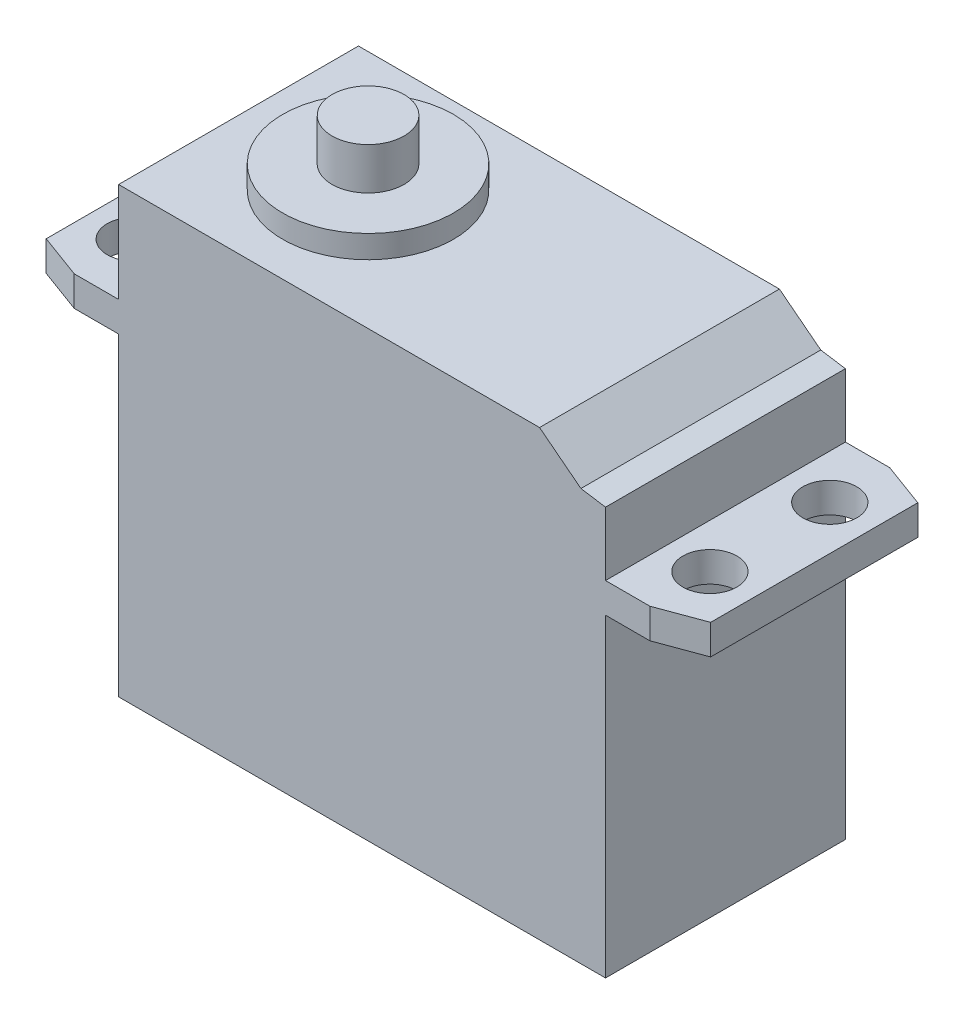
ISO-10303-21;
HEADER;
FILE_DESCRIPTION(('STEP AP214'),'2;1');
FILE_NAME('part.step','',(''),(''),'','','');
FILE_SCHEMA(('AUTOMOTIVE_DESIGN { 1 0 10303 214 1 1 1 1 }'));
ENDSEC;
DATA;
#1=APPLICATION_CONTEXT('core data for automotive mechanical design processes');
#2=APPLICATION_PROTOCOL_DEFINITION('international standard','automotive_design',2000,#1);
#3=PRODUCT_CONTEXT('',#1,'mechanical');
#4=PRODUCT('Part','Part','',(#3));
#5=PRODUCT_RELATED_PRODUCT_CATEGORY('part','',(#4));
#6=PRODUCT_DEFINITION_FORMATION('','',#4);
#7=PRODUCT_DEFINITION_CONTEXT('part definition',#1,'design');
#8=PRODUCT_DEFINITION('design','',#6,#7);
#9=PRODUCT_DEFINITION_SHAPE('','',#8);
#10=(LENGTH_UNIT() NAMED_UNIT(*) SI_UNIT(.MILLI.,.METRE.));
#11=(NAMED_UNIT(*) PLANE_ANGLE_UNIT() SI_UNIT($,.RADIAN.));
#12=(NAMED_UNIT(*) SI_UNIT($,.STERADIAN.) SOLID_ANGLE_UNIT());
#13=UNCERTAINTY_MEASURE_WITH_UNIT(LENGTH_MEASURE(1.E-05),#10,'distance_accuracy_value','');
#14=(GEOMETRIC_REPRESENTATION_CONTEXT(3) GLOBAL_UNCERTAINTY_ASSIGNED_CONTEXT((#13)) GLOBAL_UNIT_ASSIGNED_CONTEXT((#10,
#11,#12)) REPRESENTATION_CONTEXT('',''));
#15=CARTESIAN_POINT('',(0.,0.,0.));
#16=DIRECTION('',(0.,0.,1.));
#17=DIRECTION('',(1.,0.,0.));
#18=AXIS2_PLACEMENT_3D('',#15,#16,#17);
#19=CARTESIAN_POINT('',(0.,37.,0.));
#20=DIRECTION('',(1.,0.,0.));
#21=DIRECTION('',(0.,0.,-1.));
#22=AXIS2_PLACEMENT_3D('',#19,#20,#21);
#23=PLANE('',#22);
#24=DIRECTION('',(0.,-1.,0.));
#25=VECTOR('',#24,1.);
#26=CARTESIAN_POINT('',(0.,0.,-13.375));
#27=LINE('',#26,#25);
#28=CARTESIAN_POINT('',(0.,3.7,-13.375));
#29=VERTEX_POINT('',#28);
#30=CARTESIAN_POINT('',(0.,0.,-13.375));
#31=VERTEX_POINT('',#30);
#32=EDGE_CURVE('E55',#29,#31,#27,.T.);
#33=ORIENTED_EDGE('',*,*,#32,.F.);
#34=DIRECTION('',(0.,0.,-1.));
#35=VECTOR('',#34,1.);
#36=CARTESIAN_POINT('',(0.,3.7,-13.375));
#37=LINE('',#36,#35);
#38=CARTESIAN_POINT('',(0.,3.7,-6.625));
#39=VERTEX_POINT('',#38);
#40=EDGE_CURVE('E59',#39,#29,#37,.T.);
#41=ORIENTED_EDGE('',*,*,#40,.F.);
#42=DIRECTION('',(0.,1.,0.));
#43=VECTOR('',#42,1.);
#44=CARTESIAN_POINT('',(0.,0.,-6.625));
#45=LINE('',#44,#43);
#46=CARTESIAN_POINT('',(0.,0.,-6.625));
#47=VERTEX_POINT('',#46);
#48=EDGE_CURVE('E740',#47,#39,#45,.T.);
#49=ORIENTED_EDGE('',*,*,#48,.F.);
#50=DIRECTION('',(0.,0.,1.));
#51=VECTOR('',#50,1.);
#52=CARTESIAN_POINT('',(0.,0.,0.));
#53=LINE('',#52,#51);
#54=CARTESIAN_POINT('',(0.,0.,0.));
#55=VERTEX_POINT('',#54);
#56=EDGE_CURVE('E394',#47,#55,#53,.T.);
#57=ORIENTED_EDGE('',*,*,#56,.T.);
#58=DIRECTION('',(0.,-1.,0.));
#59=VECTOR('',#58,1.);
#60=CARTESIAN_POINT('',(0.,37.,0.));
#61=LINE('',#60,#59);
#62=CARTESIAN_POINT('',(0.,26.2,0.));
#63=VERTEX_POINT('',#62);
#64=EDGE_CURVE('E337',#63,#55,#61,.T.);
#65=ORIENTED_EDGE('',*,*,#64,.F.);
#66=DIRECTION('',(0.,0.,-1.));
#67=VECTOR('',#66,1.);
#68=CARTESIAN_POINT('',(0.,26.2,0.));
#69=LINE('',#68,#67);
#70=CARTESIAN_POINT('',(0.,26.2,-20.));
#71=VERTEX_POINT('',#70);
#72=EDGE_CURVE('E279',#63,#71,#69,.T.);
#73=ORIENTED_EDGE('',*,*,#72,.T.);
#74=DIRECTION('',(0.,-1.,0.));
#75=VECTOR('',#74,1.);
#76=CARTESIAN_POINT('',(0.,37.,-20.));
#77=LINE('',#76,#75);
#78=CARTESIAN_POINT('',(0.,0.,-20.));
#79=VERTEX_POINT('',#78);
#80=EDGE_CURVE('E290',#71,#79,#77,.T.);
#81=ORIENTED_EDGE('',*,*,#80,.T.);
#82=EDGE_CURVE('E409',#79,#31,#53,.T.);
#83=ORIENTED_EDGE('',*,*,#82,.T.);
#84=EDGE_LOOP('',(#33,#41,#49,#57,#65,#73,#81,#83));
#85=FACE_BOUND('',#84,.T.);
#86=ADVANCED_FACE('F37',(#85),#23,.F.);
#87=CARTESIAN_POINT('',(10.8,38.9,-10.));
#88=DIRECTION('',(0.,1.,0.));
#89=DIRECTION('',(0.,0.,1.));
#90=AXIS2_PLACEMENT_3D('',#87,#88,#89);
#91=PLANE('',#90);
#92=CARTESIAN_POINT('',(10.8,38.9,-10.));
#93=DIRECTION('',(0.,1.,0.));
#94=DIRECTION('',(0.,0.,1.));
#95=AXIS2_PLACEMENT_3D('',#92,#93,#94);
#96=CIRCLE('',#95,7.125);
#97=CARTESIAN_POINT('',(10.8,38.9,-17.125));
#98=VERTEX_POINT('',#97);
#99=EDGE_CURVE('E236',#98,#98,#96,.T.);
#100=ORIENTED_EDGE('',*,*,#99,.T.);
#101=EDGE_LOOP('',(#100));
#102=FACE_BOUND('',#101,.T.);
#103=CARTESIAN_POINT('',(10.8,38.9,-10.));
#104=DIRECTION('',(0.,1.,0.));
#105=DIRECTION('',(0.,0.,1.));
#106=AXIS2_PLACEMENT_3D('',#103,#104,#105);
#107=CIRCLE('',#106,3.);
#108=CARTESIAN_POINT('',(10.8,38.9,-7.));
#109=VERTEX_POINT('',#108);
#110=EDGE_CURVE('E229',#109,#109,#107,.T.);
#111=ORIENTED_EDGE('',*,*,#110,.F.);
#112=EDGE_LOOP('',(#111));
#113=FACE_BOUND('',#112,.T.);
#114=ADVANCED_FACE('F444',(#102,#113),#91,.T.);
#115=CARTESIAN_POINT('',(0.,37.,0.));
#116=DIRECTION('',(0.,-1.,0.));
#117=DIRECTION('',(0.,0.,-1.));
#118=AXIS2_PLACEMENT_3D('',#115,#116,#117);
#119=PLANE('',#118);
#120=DIRECTION('',(1.,0.,0.));
#121=VECTOR('',#120,1.);
#122=CARTESIAN_POINT('',(0.,37.,0.));
#123=LINE('',#122,#121);
#124=CARTESIAN_POINT('',(0.,37.,0.));
#125=VERTEX_POINT('',#124);
#126=CARTESIAN_POINT('',(35.1,37.,0.));
#127=VERTEX_POINT('',#126);
#128=EDGE_CURVE('E413',#125,#127,#123,.T.);
#129=ORIENTED_EDGE('',*,*,#128,.T.);
#130=DIRECTION('',(0.,0.,1.));
#131=VECTOR('',#130,1.);
#132=CARTESIAN_POINT('',(35.1,37.,-20.00105));
#133=LINE('',#132,#131);
#134=CARTESIAN_POINT('',(35.1,37.,-20.));
#135=VERTEX_POINT('',#134);
#136=EDGE_CURVE('E225',#135,#127,#133,.T.);
#137=ORIENTED_EDGE('',*,*,#136,.F.);
#138=DIRECTION('',(-1.,0.,0.));
#139=VECTOR('',#138,1.);
#140=CARTESIAN_POINT('',(0.,37.,-20.));
#141=LINE('',#140,#139);
#142=CARTESIAN_POINT('',(0.,37.,-20.));
#143=VERTEX_POINT('',#142);
#144=EDGE_CURVE('E335',#135,#143,#141,.T.);
#145=ORIENTED_EDGE('',*,*,#144,.T.);
#146=DIRECTION('',(0.,0.,1.));
#147=VECTOR('',#146,1.);
#148=CARTESIAN_POINT('',(0.,37.,0.));
#149=LINE('',#148,#147);
#150=EDGE_CURVE('E331',#143,#125,#149,.T.);
#151=ORIENTED_EDGE('',*,*,#150,.T.);
#152=EDGE_LOOP('',(#129,#137,#145,#151));
#153=FACE_BOUND('',#152,.T.);
#154=CARTESIAN_POINT('',(10.8,37.,-10.));
#155=DIRECTION('',(0.,-1.,0.));
#156=DIRECTION('',(0.,0.,-1.));
#157=AXIS2_PLACEMENT_3D('',#154,#155,#156);
#158=CIRCLE('',#157,7.125);
#159=CARTESIAN_POINT('',(10.8,37.,-17.125));
#160=VERTEX_POINT('',#159);
#161=EDGE_CURVE('E11',#160,#160,#158,.F.);
#162=ORIENTED_EDGE('',*,*,#161,.F.);
#163=EDGE_LOOP('',(#162));
#164=FACE_BOUND('',#163,.T.);
#165=ADVANCED_FACE('F448',(#153,#164),#119,.F.);
#166=CARTESIAN_POINT('',(-7.4,28.7,0.));
#167=DIRECTION('',(0.,1.,0.));
#168=DIRECTION('',(0.,0.,1.));
#169=AXIS2_PLACEMENT_3D('',#166,#167,#168);
#170=PLANE('',#169);
#171=CARTESIAN_POINT('',(-3.7,28.7,-15.));
#172=DIRECTION('',(0.,-1.,0.));
#173=DIRECTION('',(0.,0.,1.));
#174=AXIS2_PLACEMENT_3D('',#171,#172,#173);
#175=CIRCLE('',#174,2.25);
#176=CARTESIAN_POINT('',(-3.7,28.7,-12.75));
#177=VERTEX_POINT('',#176);
#178=EDGE_CURVE('E268',#177,#177,#175,.T.);
#179=ORIENTED_EDGE('',*,*,#178,.T.);
#180=EDGE_LOOP('',(#179));
#181=FACE_BOUND('',#180,.T.);
#182=CARTESIAN_POINT('',(-3.7,28.7,-5.));
#183=DIRECTION('',(0.,-1.,0.));
#184=DIRECTION('',(0.,0.,-1.));
#185=AXIS2_PLACEMENT_3D('',#182,#183,#184);
#186=CIRCLE('',#185,2.25);
#187=CARTESIAN_POINT('',(-3.7,28.7,-7.25));
#188=VERTEX_POINT('',#187);
#189=EDGE_CURVE('E261',#188,#188,#186,.T.);
#190=ORIENTED_EDGE('',*,*,#189,.T.);
#191=EDGE_LOOP('',(#190));
#192=FACE_BOUND('',#191,.T.);
#193=DIRECTION('',(0.,0.,1.));
#194=VECTOR('',#193,1.);
#195=CARTESIAN_POINT('',(-7.4,28.7,0.));
#196=LINE('',#195,#194);
#197=CARTESIAN_POINT('',(-7.4,28.7,-18.635703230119));
#198=VERTEX_POINT('',#197);
#199=CARTESIAN_POINT('',(-7.4,28.7,-1.36429676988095));
#200=VERTEX_POINT('',#199);
#201=EDGE_CURVE('E275',#198,#200,#196,.T.);
#202=ORIENTED_EDGE('',*,*,#201,.T.);
#203=DIRECTION('',(0.93824939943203,0.,0.345959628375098));
#204=VECTOR('',#203,1.);
#205=CARTESIAN_POINT('',(-3.7,28.7,0.));
#206=LINE('',#205,#204);
#207=CARTESIAN_POINT('',(-3.7,28.7,0.));
#208=VERTEX_POINT('',#207);
#209=EDGE_CURVE('E241',#200,#208,#206,.T.);
#210=ORIENTED_EDGE('',*,*,#209,.T.);
#211=DIRECTION('',(1.,0.,0.));
#212=VECTOR('',#211,1.);
#213=CARTESIAN_POINT('',(-7.4,28.7,0.));
#214=LINE('',#213,#212);
#215=CARTESIAN_POINT('',(0.,28.7,0.));
#216=VERTEX_POINT('',#215);
#217=EDGE_CURVE('E298',#208,#216,#214,.T.);
#218=ORIENTED_EDGE('',*,*,#217,.T.);
#219=DIRECTION('',(0.,0.,1.));
#220=VECTOR('',#219,1.);
#221=CARTESIAN_POINT('',(0.,28.7,0.));
#222=LINE('',#221,#220);
#223=CARTESIAN_POINT('',(0.,28.7,-20.));
#224=VERTEX_POINT('',#223);
#225=EDGE_CURVE('E274',#224,#216,#222,.T.);
#226=ORIENTED_EDGE('',*,*,#225,.F.);
#227=DIRECTION('',(1.,0.,0.));
#228=VECTOR('',#227,1.);
#229=CARTESIAN_POINT('',(-7.4,28.7,-20.));
#230=LINE('',#229,#228);
#231=CARTESIAN_POINT('',(-3.7,28.7,-20.));
#232=VERTEX_POINT('',#231);
#233=EDGE_CURVE('E302',#232,#224,#230,.T.);
#234=ORIENTED_EDGE('',*,*,#233,.F.);
#235=DIRECTION('',(-0.93824939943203,0.,0.345959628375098));
#236=VECTOR('',#235,1.);
#237=CARTESIAN_POINT('',(-3.7,28.7,-20.));
#238=LINE('',#237,#236);
#239=EDGE_CURVE('E254',#232,#198,#238,.T.);
#240=ORIENTED_EDGE('',*,*,#239,.T.);
#241=EDGE_LOOP('',(#202,#210,#218,#226,#234,#240));
#242=FACE_BOUND('',#241,.T.);
#243=ADVANCED_FACE('F325',(#181,#192,#242),#170,.T.);
#244=CARTESIAN_POINT('',(-7.4,26.2,0.));
#245=DIRECTION('',(0.,-1.,0.));
#246=DIRECTION('',(0.,0.,-1.));
#247=AXIS2_PLACEMENT_3D('',#244,#245,#246);
#248=PLANE('',#247);
#249=CARTESIAN_POINT('',(-3.7,26.2,-15.));
#250=DIRECTION('',(0.,-1.,0.));
#251=DIRECTION('',(0.,0.,-1.));
#252=AXIS2_PLACEMENT_3D('',#249,#250,#251);
#253=CIRCLE('',#252,2.25);
#254=CARTESIAN_POINT('',(-3.7,26.2,-17.25));
#255=VERTEX_POINT('',#254);
#256=EDGE_CURVE('E271',#255,#255,#253,.T.);
#257=ORIENTED_EDGE('',*,*,#256,.F.);
#258=EDGE_LOOP('',(#257));
#259=FACE_BOUND('',#258,.T.);
#260=CARTESIAN_POINT('',(-3.7,26.2,-5.));
#261=DIRECTION('',(0.,-1.,0.));
#262=DIRECTION('',(0.,0.,-1.));
#263=AXIS2_PLACEMENT_3D('',#260,#261,#262);
#264=CIRCLE('',#263,2.25);
#265=CARTESIAN_POINT('',(-3.7,26.2,-7.25));
#266=VERTEX_POINT('',#265);
#267=EDGE_CURVE('E265',#266,#266,#264,.T.);
#268=ORIENTED_EDGE('',*,*,#267,.F.);
#269=EDGE_LOOP('',(#268));
#270=FACE_BOUND('',#269,.T.);
#271=DIRECTION('',(1.,0.,0.));
#272=VECTOR('',#271,1.);
#273=CARTESIAN_POINT('',(-7.4,26.2,0.));
#274=LINE('',#273,#272);
#275=CARTESIAN_POINT('',(-3.70000000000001,26.2,0.));
#276=VERTEX_POINT('',#275);
#277=EDGE_CURVE('E281',#276,#63,#274,.T.);
#278=ORIENTED_EDGE('',*,*,#277,.F.);
#279=DIRECTION('',(0.93824939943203,0.,0.345959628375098));
#280=VECTOR('',#279,1.);
#281=CARTESIAN_POINT('',(-3.7,26.2,0.));
#282=LINE('',#281,#280);
#283=CARTESIAN_POINT('',(-7.4,26.2,-1.36429676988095));
#284=VERTEX_POINT('',#283);
#285=EDGE_CURVE('E248',#284,#276,#282,.T.);
#286=ORIENTED_EDGE('',*,*,#285,.F.);
#287=DIRECTION('',(0.,0.,-1.));
#288=VECTOR('',#287,1.);
#289=CARTESIAN_POINT('',(-7.4,26.2,0.));
#290=LINE('',#289,#288);
#291=CARTESIAN_POINT('',(-7.4,26.2,-18.635703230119));
#292=VERTEX_POINT('',#291);
#293=EDGE_CURVE('E278',#284,#292,#290,.T.);
#294=ORIENTED_EDGE('',*,*,#293,.T.);
#295=DIRECTION('',(-0.93824939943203,0.,0.345959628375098));
#296=VECTOR('',#295,1.);
#297=CARTESIAN_POINT('',(-3.7,26.2,-20.));
#298=LINE('',#297,#296);
#299=CARTESIAN_POINT('',(-3.7,26.2,-20.));
#300=VERTEX_POINT('',#299);
#301=EDGE_CURVE('E251',#300,#292,#298,.T.);
#302=ORIENTED_EDGE('',*,*,#301,.F.);
#303=DIRECTION('',(1.,0.,0.));
#304=VECTOR('',#303,1.);
#305=CARTESIAN_POINT('',(-7.4,26.2,-20.));
#306=LINE('',#305,#304);
#307=EDGE_CURVE('E305',#300,#71,#306,.T.);
#308=ORIENTED_EDGE('',*,*,#307,.T.);
#309=ORIENTED_EDGE('',*,*,#72,.F.);
#310=EDGE_LOOP('',(#278,#286,#294,#302,#308,#309));
#311=FACE_BOUND('',#310,.T.);
#312=ADVANCED_FACE('F420',(#259,#270,#311),#248,.T.);
#313=CARTESIAN_POINT('',(-7.4,0.,0.));
#314=DIRECTION('',(-1.,0.,0.));
#315=DIRECTION('',(0.,0.,-1.));
#316=AXIS2_PLACEMENT_3D('',#313,#314,#315);
#317=PLANE('',#316);
#318=ORIENTED_EDGE('',*,*,#293,.F.);
#319=DIRECTION('',(0.,1.,0.));
#320=VECTOR('',#319,1.);
#321=CARTESIAN_POINT('',(-7.4,-0.00102500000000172,-1.36429676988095));
#322=LINE('',#321,#320);
#323=EDGE_CURVE('E245',#284,#200,#322,.T.);
#324=ORIENTED_EDGE('',*,*,#323,.T.);
#325=ORIENTED_EDGE('',*,*,#201,.F.);
#326=DIRECTION('',(0.,1.,0.));
#327=VECTOR('',#326,1.);
#328=CARTESIAN_POINT('',(-7.4,-0.00102500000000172,-18.635703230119));
#329=LINE('',#328,#327);
#330=EDGE_CURVE('E257',#292,#198,#329,.T.);
#331=ORIENTED_EDGE('',*,*,#330,.F.);
#332=EDGE_LOOP('',(#318,#324,#325,#331));
#333=FACE_BOUND('',#332,.T.);
#334=ADVANCED_FACE('F426',(#333),#317,.T.);
#335=CARTESIAN_POINT('',(0.,37.,0.));
#336=DIRECTION('',(0.,0.,-1.));
#337=DIRECTION('',(-1.,0.,0.));
#338=AXIS2_PLACEMENT_3D('',#335,#336,#337);
#339=PLANE('',#338);
#340=DIRECTION('',(0.,-1.,0.));
#341=VECTOR('',#340,1.);
#342=CARTESIAN_POINT('',(40.6,37.,0.));
#343=LINE('',#342,#341);
#344=CARTESIAN_POINT('',(40.6,34.,0.));
#345=VERTEX_POINT('',#344);
#346=CARTESIAN_POINT('',(40.6,28.7,0.));
#347=VERTEX_POINT('',#346);
#348=EDGE_CURVE('E41',#345,#347,#343,.T.);
#349=ORIENTED_EDGE('',*,*,#348,.F.);
#350=DIRECTION('',(0.987921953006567,-0.154952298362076,0.));
#351=VECTOR('',#350,1.);
#352=CARTESIAN_POINT('',(40.6,34.,0.));
#353=LINE('',#352,#351);
#354=CARTESIAN_POINT('',(38.5477492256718,34.3218887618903,0.));
#355=VERTEX_POINT('',#354);
#356=EDGE_CURVE('E223',#355,#345,#353,.T.);
#357=ORIENTED_EDGE('',*,*,#356,.F.);
#358=DIRECTION('',(0.789737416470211,-0.613445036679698,0.));
#359=VECTOR('',#358,1.);
#360=CARTESIAN_POINT('',(38.5477492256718,34.3218887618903,0.));
#361=LINE('',#360,#359);
#362=EDGE_CURVE('E220',#127,#355,#361,.T.);
#363=ORIENTED_EDGE('',*,*,#362,.F.);
#364=ORIENTED_EDGE('',*,*,#128,.F.);
#365=EDGE_CURVE('E47',#125,#216,#61,.T.);
#366=ORIENTED_EDGE('',*,*,#365,.T.);
#367=ORIENTED_EDGE('',*,*,#217,.F.);
#368=DIRECTION('',(0.,1.,0.));
#369=VECTOR('',#368,1.);
#370=CARTESIAN_POINT('',(-3.7,-0.00102500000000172,0.));
#371=LINE('',#370,#369);
#372=EDGE_CURVE('E244',#276,#208,#371,.T.);
#373=ORIENTED_EDGE('',*,*,#372,.F.);
#374=ORIENTED_EDGE('',*,*,#277,.T.);
#375=ORIENTED_EDGE('',*,*,#64,.T.);
#376=DIRECTION('',(1.,0.,0.));
#377=VECTOR('',#376,1.);
#378=CARTESIAN_POINT('',(0.,0.,0.));
#379=LINE('',#378,#377);
#380=CARTESIAN_POINT('',(40.6,0.,0.));
#381=VERTEX_POINT('',#380);
#382=EDGE_CURVE('E403',#55,#381,#379,.T.);
#383=ORIENTED_EDGE('',*,*,#382,.T.);
#384=CARTESIAN_POINT('',(40.6,26.2,0.));
#385=VERTEX_POINT('',#384);
#386=EDGE_CURVE('E350',#385,#381,#343,.T.);
#387=ORIENTED_EDGE('',*,*,#386,.F.);
#388=DIRECTION('',(-1.,0.,0.));
#389=VECTOR('',#388,1.);
#390=CARTESIAN_POINT('',(48.,26.2,0.));
#391=LINE('',#390,#389);
#392=CARTESIAN_POINT('',(44.3,26.2,0.));
#393=VERTEX_POINT('',#392);
#394=EDGE_CURVE('E393',#393,#385,#391,.T.);
#395=ORIENTED_EDGE('',*,*,#394,.F.);
#396=DIRECTION('',(0.,1.,0.));
#397=VECTOR('',#396,1.);
#398=CARTESIAN_POINT('',(44.3,-0.00102500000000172,0.));
#399=LINE('',#398,#397);
#400=CARTESIAN_POINT('',(44.3,28.7,0.));
#401=VERTEX_POINT('',#400);
#402=EDGE_CURVE('E764',#393,#401,#399,.T.);
#403=ORIENTED_EDGE('',*,*,#402,.T.);
#404=DIRECTION('',(-1.,0.,0.));
#405=VECTOR('',#404,1.);
#406=CARTESIAN_POINT('',(48.,28.7,0.));
#407=LINE('',#406,#405);
#408=EDGE_CURVE('E387',#401,#347,#407,.T.);
#409=ORIENTED_EDGE('',*,*,#408,.T.);
#410=EDGE_LOOP('',(#349,#357,#363,#364,#366,#367,#373,#374,#375,#383,#387,#395,#403,#409));
#411=FACE_BOUND('',#410,.T.);
#412=ADVANCED_FACE('F402',(#411),#339,.F.);
#413=CARTESIAN_POINT('',(0.,37.,-20.));
#414=DIRECTION('',(0.,0.,1.));
#415=DIRECTION('',(1.,0.,0.));
#416=AXIS2_PLACEMENT_3D('',#413,#414,#415);
#417=PLANE('',#416);
#418=DIRECTION('',(-0.789737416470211,0.613445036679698,0.));
#419=VECTOR('',#418,1.);
#420=CARTESIAN_POINT('',(38.5477492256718,34.3218887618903,-20.));
#421=LINE('',#420,#419);
#422=CARTESIAN_POINT('',(38.5477492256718,34.3218887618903,-20.));
#423=VERTEX_POINT('',#422);
#424=EDGE_CURVE('E210',#423,#135,#421,.T.);
#425=ORIENTED_EDGE('',*,*,#424,.F.);
#426=DIRECTION('',(-0.987921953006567,0.154952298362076,0.));
#427=VECTOR('',#426,1.);
#428=CARTESIAN_POINT('',(40.6,34.,-20.));
#429=LINE('',#428,#427);
#430=CARTESIAN_POINT('',(40.6,34.,-20.));
#431=VERTEX_POINT('',#430);
#432=EDGE_CURVE('E212',#431,#423,#429,.T.);
#433=ORIENTED_EDGE('',*,*,#432,.F.);
#434=DIRECTION('',(0.,-1.,0.));
#435=VECTOR('',#434,1.);
#436=CARTESIAN_POINT('',(40.6,37.,-20.));
#437=LINE('',#436,#435);
#438=CARTESIAN_POINT('',(40.6,28.7,-20.));
#439=VERTEX_POINT('',#438);
#440=EDGE_CURVE('E333',#431,#439,#437,.T.);
#441=ORIENTED_EDGE('',*,*,#440,.T.);
#442=DIRECTION('',(-1.,0.,0.));
#443=VECTOR('',#442,1.);
#444=CARTESIAN_POINT('',(48.,28.7,-20.));
#445=LINE('',#444,#443);
#446=CARTESIAN_POINT('',(44.3,28.7,-20.));
#447=VERTEX_POINT('',#446);
#448=EDGE_CURVE('E391',#447,#439,#445,.T.);
#449=ORIENTED_EDGE('',*,*,#448,.F.);
#450=DIRECTION('',(0.,1.,0.));
#451=VECTOR('',#450,1.);
#452=CARTESIAN_POINT('',(44.3,-0.00102500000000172,-20.));
#453=LINE('',#452,#451);
#454=CARTESIAN_POINT('',(44.3,26.2,-20.));
#455=VERTEX_POINT('',#454);
#456=EDGE_CURVE('E757',#455,#447,#453,.T.);
#457=ORIENTED_EDGE('',*,*,#456,.F.);
#458=DIRECTION('',(-1.,0.,0.));
#459=VECTOR('',#458,1.);
#460=CARTESIAN_POINT('',(48.,26.2,-20.));
#461=LINE('',#460,#459);
#462=CARTESIAN_POINT('',(40.6,26.2,-20.));
#463=VERTEX_POINT('',#462);
#464=EDGE_CURVE('E392',#455,#463,#461,.T.);
#465=ORIENTED_EDGE('',*,*,#464,.T.);
#466=CARTESIAN_POINT('',(40.6,0.,-20.));
#467=VERTEX_POINT('',#466);
#468=EDGE_CURVE('E332',#463,#467,#437,.T.);
#469=ORIENTED_EDGE('',*,*,#468,.T.);
#470=DIRECTION('',(-1.,0.,0.));
#471=VECTOR('',#470,1.);
#472=CARTESIAN_POINT('',(0.,0.,-20.));
#473=LINE('',#472,#471);
#474=EDGE_CURVE('E343',#467,#79,#473,.T.);
#475=ORIENTED_EDGE('',*,*,#474,.T.);
#476=ORIENTED_EDGE('',*,*,#80,.F.);
#477=ORIENTED_EDGE('',*,*,#307,.F.);
#478=DIRECTION('',(0.,1.,0.));
#479=VECTOR('',#478,1.);
#480=CARTESIAN_POINT('',(-3.7,-0.00102500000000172,-20.));
#481=LINE('',#480,#479);
#482=EDGE_CURVE('E258',#300,#232,#481,.T.);
#483=ORIENTED_EDGE('',*,*,#482,.T.);
#484=ORIENTED_EDGE('',*,*,#233,.T.);
#485=EDGE_CURVE('E322',#143,#224,#77,.T.);
#486=ORIENTED_EDGE('',*,*,#485,.F.);
#487=ORIENTED_EDGE('',*,*,#144,.F.);
#488=EDGE_LOOP('',(#425,#433,#441,#449,#457,#465,#469,#475,#476,#477,#483,#484,#486,#487));
#489=FACE_BOUND('',#488,.T.);
#490=ADVANCED_FACE('F319',(#489),#417,.F.);
#491=CARTESIAN_POINT('',(40.6,37.,0.));
#492=DIRECTION('',(-1.,0.,0.));
#493=DIRECTION('',(0.,0.,1.));
#494=AXIS2_PLACEMENT_3D('',#491,#492,#493);
#495=PLANE('',#494);
#496=ORIENTED_EDGE('',*,*,#440,.F.);
#497=DIRECTION('',(0.,0.,1.));
#498=VECTOR('',#497,1.);
#499=CARTESIAN_POINT('',(40.6,34.,-20.00105));
#500=LINE('',#499,#498);
#501=EDGE_CURVE('E226',#431,#345,#500,.T.);
#502=ORIENTED_EDGE('',*,*,#501,.T.);
#503=ORIENTED_EDGE('',*,*,#348,.T.);
#504=DIRECTION('',(0.,0.,1.));
#505=VECTOR('',#504,1.);
#506=CARTESIAN_POINT('',(40.6,28.7,0.));
#507=LINE('',#506,#505);
#508=EDGE_CURVE('E365',#439,#347,#507,.T.);
#509=ORIENTED_EDGE('',*,*,#508,.F.);
#510=EDGE_LOOP('',(#496,#502,#503,#509));
#511=FACE_BOUND('',#510,.T.);
#512=ADVANCED_FACE('F459',(#511),#495,.F.);
#513=DIRECTION('',(0.,0.,-1.));
#514=VECTOR('',#513,1.);
#515=CARTESIAN_POINT('',(40.6,26.2,0.));
#516=LINE('',#515,#514);
#517=EDGE_CURVE('E361',#385,#463,#516,.T.);
#518=ORIENTED_EDGE('',*,*,#517,.F.);
#519=ORIENTED_EDGE('',*,*,#386,.T.);
#520=DIRECTION('',(0.,0.,-1.));
#521=VECTOR('',#520,1.);
#522=CARTESIAN_POINT('',(40.6,0.,0.));
#523=LINE('',#522,#521);
#524=EDGE_CURVE('E408',#381,#467,#523,.T.);
#525=ORIENTED_EDGE('',*,*,#524,.T.);
#526=ORIENTED_EDGE('',*,*,#468,.F.);
#527=EDGE_LOOP('',(#518,#519,#525,#526));
#528=FACE_BOUND('',#527,.T.);
#529=ADVANCED_FACE('F452',(#528),#495,.F.);
#530=ORIENTED_EDGE('',*,*,#485,.T.);
#531=ORIENTED_EDGE('',*,*,#225,.T.);
#532=ORIENTED_EDGE('',*,*,#365,.F.);
#533=ORIENTED_EDGE('',*,*,#150,.F.);
#534=EDGE_LOOP('',(#530,#531,#532,#533));
#535=FACE_BOUND('',#534,.T.);
#536=ADVANCED_FACE('F39',(#535),#23,.F.);
#537=CARTESIAN_POINT('',(0.,0.,0.));
#538=DIRECTION('',(0.,-1.,0.));
#539=DIRECTION('',(0.,0.,-1.));
#540=AXIS2_PLACEMENT_3D('',#537,#538,#539);
#541=PLANE('',#540);
#542=ORIENTED_EDGE('',*,*,#82,.F.);
#543=ORIENTED_EDGE('',*,*,#474,.F.);
#544=ORIENTED_EDGE('',*,*,#524,.F.);
#545=ORIENTED_EDGE('',*,*,#382,.F.);
#546=ORIENTED_EDGE('',*,*,#56,.F.);
#547=DIRECTION('',(1.,0.,0.));
#548=VECTOR('',#547,1.);
#549=CARTESIAN_POINT('',(-2.,0.,-6.625));
#550=LINE('',#549,#548);
#551=CARTESIAN_POINT('',(-2.,0.,-6.625));
#552=VERTEX_POINT('',#551);
#553=EDGE_CURVE('E195',#552,#47,#550,.T.);
#554=ORIENTED_EDGE('',*,*,#553,.F.);
#555=DIRECTION('',(0.,0.,1.));
#556=VECTOR('',#555,1.);
#557=CARTESIAN_POINT('',(-2.,0.,-13.375));
#558=LINE('',#557,#556);
#559=CARTESIAN_POINT('',(-2.,0.,-13.375));
#560=VERTEX_POINT('',#559);
#561=EDGE_CURVE('E188',#560,#552,#558,.T.);
#562=ORIENTED_EDGE('',*,*,#561,.F.);
#563=DIRECTION('',(1.,0.,0.));
#564=VECTOR('',#563,1.);
#565=CARTESIAN_POINT('',(-2.,0.,-13.375));
#566=LINE('',#565,#564);
#567=EDGE_CURVE('E193',#560,#31,#566,.T.);
#568=ORIENTED_EDGE('',*,*,#567,.T.);
#569=EDGE_LOOP('',(#542,#543,#544,#545,#546,#554,#562,#568));
#570=FACE_BOUND('',#569,.T.);
#571=ADVANCED_FACE('F191',(#570),#541,.T.);
#572=CARTESIAN_POINT('',(48.,26.2,0.));
#573=DIRECTION('',(0.,1.,0.));
#574=DIRECTION('',(0.,0.,1.));
#575=AXIS2_PLACEMENT_3D('',#572,#573,#574);
#576=PLANE('',#575);
#577=CARTESIAN_POINT('',(44.3,26.2,-5.));
#578=DIRECTION('',(0.,1.,0.));
#579=DIRECTION('',(0.,0.,1.));
#580=AXIS2_PLACEMENT_3D('',#577,#578,#579);
#581=CIRCLE('',#580,2.25);
#582=CARTESIAN_POINT('',(44.3,26.2,-2.75));
#583=VERTEX_POINT('',#582);
#584=EDGE_CURVE('E781',#583,#583,#581,.F.);
#585=ORIENTED_EDGE('',*,*,#584,.F.);
#586=EDGE_LOOP('',(#585));
#587=FACE_BOUND('',#586,.T.);
#588=CARTESIAN_POINT('',(44.3,26.2,-15.));
#589=DIRECTION('',(0.,1.,0.));
#590=DIRECTION('',(0.,0.,1.));
#591=AXIS2_PLACEMENT_3D('',#588,#589,#590);
#592=CIRCLE('',#591,2.25);
#593=CARTESIAN_POINT('',(44.3,26.2,-12.75));
#594=VERTEX_POINT('',#593);
#595=EDGE_CURVE('E366',#594,#594,#592,.F.);
#596=ORIENTED_EDGE('',*,*,#595,.F.);
#597=EDGE_LOOP('',(#596));
#598=FACE_BOUND('',#597,.T.);
#599=DIRECTION('',(0.,0.,-1.));
#600=VECTOR('',#599,1.);
#601=CARTESIAN_POINT('',(48.,26.2,0.));
#602=LINE('',#601,#600);
#603=CARTESIAN_POINT('',(48.,26.2,-1.36429676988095));
#604=VERTEX_POINT('',#603);
#605=CARTESIAN_POINT('',(48.,26.2,-18.635703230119));
#606=VERTEX_POINT('',#605);
#607=EDGE_CURVE('E380',#604,#606,#602,.T.);
#608=ORIENTED_EDGE('',*,*,#607,.F.);
#609=DIRECTION('',(0.93824939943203,0.,-0.345959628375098));
#610=VECTOR('',#609,1.);
#611=CARTESIAN_POINT('',(44.3,26.2,0.));
#612=LINE('',#611,#610);
#613=EDGE_CURVE('E301',#393,#604,#612,.T.);
#614=ORIENTED_EDGE('',*,*,#613,.F.);
#615=ORIENTED_EDGE('',*,*,#394,.T.);
#616=ORIENTED_EDGE('',*,*,#517,.T.);
#617=ORIENTED_EDGE('',*,*,#464,.F.);
#618=DIRECTION('',(-0.93824939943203,0.,-0.345959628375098));
#619=VECTOR('',#618,1.);
#620=CARTESIAN_POINT('',(44.3,26.2,-20.));
#621=LINE('',#620,#619);
#622=EDGE_CURVE('E775',#606,#455,#621,.T.);
#623=ORIENTED_EDGE('',*,*,#622,.F.);
#624=EDGE_LOOP('',(#608,#614,#615,#616,#617,#623));
#625=FACE_BOUND('',#624,.T.);
#626=ADVANCED_FACE('F457',(#587,#598,#625),#576,.F.);
#627=CARTESIAN_POINT('',(48.,28.7,0.));
#628=DIRECTION('',(0.,-1.,0.));
#629=DIRECTION('',(0.,0.,-1.));
#630=AXIS2_PLACEMENT_3D('',#627,#628,#629);
#631=PLANE('',#630);
#632=CARTESIAN_POINT('',(44.3,28.7,-5.));
#633=DIRECTION('',(0.,1.,0.));
#634=DIRECTION('',(0.,0.,-1.));
#635=AXIS2_PLACEMENT_3D('',#632,#633,#634);
#636=CIRCLE('',#635,2.25);
#637=CARTESIAN_POINT('',(44.3,28.7,-7.25));
#638=VERTEX_POINT('',#637);
#639=EDGE_CURVE('E778',#638,#638,#636,.T.);
#640=ORIENTED_EDGE('',*,*,#639,.F.);
#641=EDGE_LOOP('',(#640));
#642=FACE_BOUND('',#641,.T.);
#643=CARTESIAN_POINT('',(44.3,28.7,-15.));
#644=DIRECTION('',(0.,1.,0.));
#645=DIRECTION('',(0.,0.,1.));
#646=AXIS2_PLACEMENT_3D('',#643,#644,#645);
#647=CIRCLE('',#646,2.25);
#648=CARTESIAN_POINT('',(44.3,28.7,-12.75));
#649=VERTEX_POINT('',#648);
#650=EDGE_CURVE('E784',#649,#649,#647,.T.);
#651=ORIENTED_EDGE('',*,*,#650,.F.);
#652=EDGE_LOOP('',(#651));
#653=FACE_BOUND('',#652,.T.);
#654=ORIENTED_EDGE('',*,*,#408,.F.);
#655=DIRECTION('',(-0.93824939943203,0.,0.345959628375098));
#656=VECTOR('',#655,1.);
#657=CARTESIAN_POINT('',(44.3,28.7,0.));
#658=LINE('',#657,#656);
#659=CARTESIAN_POINT('',(48.,28.7,-1.36429676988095));
#660=VERTEX_POINT('',#659);
#661=EDGE_CURVE('E768',#660,#401,#658,.T.);
#662=ORIENTED_EDGE('',*,*,#661,.F.);
#663=DIRECTION('',(0.,0.,1.));
#664=VECTOR('',#663,1.);
#665=CARTESIAN_POINT('',(48.,28.7,0.));
#666=LINE('',#665,#664);
#667=CARTESIAN_POINT('',(48.,28.7,-18.635703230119));
#668=VERTEX_POINT('',#667);
#669=EDGE_CURVE('E372',#668,#660,#666,.T.);
#670=ORIENTED_EDGE('',*,*,#669,.F.);
#671=DIRECTION('',(0.93824939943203,0.,0.345959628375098));
#672=VECTOR('',#671,1.);
#673=CARTESIAN_POINT('',(44.3,28.7,-20.));
#674=LINE('',#673,#672);
#675=EDGE_CURVE('E754',#447,#668,#674,.T.);
#676=ORIENTED_EDGE('',*,*,#675,.F.);
#677=ORIENTED_EDGE('',*,*,#448,.T.);
#678=ORIENTED_EDGE('',*,*,#508,.T.);
#679=EDGE_LOOP('',(#654,#662,#670,#676,#677,#678));
#680=FACE_BOUND('',#679,.T.);
#681=ADVANCED_FACE('F503',(#642,#653,#680),#631,.F.);
#682=CARTESIAN_POINT('',(48.,0.,0.));
#683=DIRECTION('',(1.,0.,0.));
#684=DIRECTION('',(0.,0.,-1.));
#685=AXIS2_PLACEMENT_3D('',#682,#683,#684);
#686=PLANE('',#685);
#687=DIRECTION('',(0.,1.,0.));
#688=VECTOR('',#687,1.);
#689=CARTESIAN_POINT('',(48.,-0.00102500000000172,-1.36429676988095));
#690=LINE('',#689,#688);
#691=EDGE_CURVE('E765',#604,#660,#690,.T.);
#692=ORIENTED_EDGE('',*,*,#691,.F.);
#693=ORIENTED_EDGE('',*,*,#607,.T.);
#694=DIRECTION('',(0.,1.,0.));
#695=VECTOR('',#694,1.);
#696=CARTESIAN_POINT('',(48.,-0.00102500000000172,-18.635703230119));
#697=LINE('',#696,#695);
#698=EDGE_CURVE('E772',#606,#668,#697,.T.);
#699=ORIENTED_EDGE('',*,*,#698,.T.);
#700=ORIENTED_EDGE('',*,*,#669,.T.);
#701=EDGE_LOOP('',(#692,#693,#699,#700));
#702=FACE_BOUND('',#701,.T.);
#703=ADVANCED_FACE('F499',(#702),#686,.T.);
#704=CARTESIAN_POINT('',(44.3,-0.00102500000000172,-15.));
#705=DIRECTION('',(0.,1.,0.));
#706=DIRECTION('',(0.,0.,1.));
#707=AXIS2_PLACEMENT_3D('',#704,#705,#706);
#708=CYLINDRICAL_SURFACE('',#707,2.25);
#709=ORIENTED_EDGE('',*,*,#650,.T.);
#710=EDGE_LOOP('',(#709));
#711=FACE_BOUND('',#710,.T.);
#712=ORIENTED_EDGE('',*,*,#595,.T.);
#713=EDGE_LOOP('',(#712));
#714=FACE_BOUND('',#713,.T.);
#715=ADVANCED_FACE('F495',(#711,#714),#708,.F.);
#716=CARTESIAN_POINT('',(44.3,-0.00102500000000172,-5.));
#717=DIRECTION('',(0.,1.,0.));
#718=DIRECTION('',(0.,0.,1.));
#719=AXIS2_PLACEMENT_3D('',#716,#717,#718);
#720=CYLINDRICAL_SURFACE('',#719,2.25);
#721=ORIENTED_EDGE('',*,*,#639,.T.);
#722=EDGE_LOOP('',(#721));
#723=FACE_BOUND('',#722,.T.);
#724=ORIENTED_EDGE('',*,*,#584,.T.);
#725=EDGE_LOOP('',(#724));
#726=FACE_BOUND('',#725,.T.);
#727=ADVANCED_FACE('F491',(#723,#726),#720,.F.);
#728=CARTESIAN_POINT('',(44.3,-0.00102500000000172,-20.));
#729=DIRECTION('',(-0.345959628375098,0.,0.938249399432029));
#730=DIRECTION('',(0.93824939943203,0.,0.345959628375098));
#731=AXIS2_PLACEMENT_3D('',#728,#729,#730);
#732=PLANE('',#731);
#733=ORIENTED_EDGE('',*,*,#622,.T.);
#734=ORIENTED_EDGE('',*,*,#456,.T.);
#735=ORIENTED_EDGE('',*,*,#675,.T.);
#736=ORIENTED_EDGE('',*,*,#698,.F.);
#737=EDGE_LOOP('',(#733,#734,#735,#736));
#738=FACE_BOUND('',#737,.T.);
#739=ADVANCED_FACE('F487',(#738),#732,.F.);
#740=CARTESIAN_POINT('',(44.3,-0.00102500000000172,0.));
#741=DIRECTION('',(-0.345959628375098,0.,-0.938249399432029));
#742=DIRECTION('',(-0.93824939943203,0.,0.345959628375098));
#743=AXIS2_PLACEMENT_3D('',#740,#741,#742);
#744=PLANE('',#743);
#745=ORIENTED_EDGE('',*,*,#613,.T.);
#746=ORIENTED_EDGE('',*,*,#691,.T.);
#747=ORIENTED_EDGE('',*,*,#661,.T.);
#748=ORIENTED_EDGE('',*,*,#402,.F.);
#749=EDGE_LOOP('',(#745,#746,#747,#748));
#750=FACE_BOUND('',#749,.T.);
#751=ADVANCED_FACE('F484',(#750),#744,.F.);
#752=CARTESIAN_POINT('',(-3.7,-0.00102500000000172,-15.));
#753=DIRECTION('',(0.,1.,0.));
#754=DIRECTION('',(0.,0.,1.));
#755=AXIS2_PLACEMENT_3D('',#752,#753,#754);
#756=CYLINDRICAL_SURFACE('',#755,2.25);
#757=ORIENTED_EDGE('',*,*,#256,.T.);
#758=EDGE_LOOP('',(#757));
#759=FACE_BOUND('',#758,.T.);
#760=ORIENTED_EDGE('',*,*,#178,.F.);
#761=EDGE_LOOP('',(#760));
#762=FACE_BOUND('',#761,.T.);
#763=ADVANCED_FACE('F478',(#759,#762),#756,.F.);
#764=CARTESIAN_POINT('',(-3.7,-0.00102500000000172,-5.));
#765=DIRECTION('',(0.,1.,0.));
#766=DIRECTION('',(0.,0.,1.));
#767=AXIS2_PLACEMENT_3D('',#764,#765,#766);
#768=CYLINDRICAL_SURFACE('',#767,2.25);
#769=ORIENTED_EDGE('',*,*,#267,.T.);
#770=EDGE_LOOP('',(#769));
#771=FACE_BOUND('',#770,.T.);
#772=ORIENTED_EDGE('',*,*,#189,.F.);
#773=EDGE_LOOP('',(#772));
#774=FACE_BOUND('',#773,.T.);
#775=ADVANCED_FACE('F441',(#771,#774),#768,.F.);
#776=CARTESIAN_POINT('',(-3.7,-0.00102500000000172,-20.));
#777=DIRECTION('',(-0.345959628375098,0.,-0.938249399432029));
#778=DIRECTION('',(-0.93824939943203,0.,0.345959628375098));
#779=AXIS2_PLACEMENT_3D('',#776,#777,#778);
#780=PLANE('',#779);
#781=ORIENTED_EDGE('',*,*,#301,.T.);
#782=ORIENTED_EDGE('',*,*,#330,.T.);
#783=ORIENTED_EDGE('',*,*,#239,.F.);
#784=ORIENTED_EDGE('',*,*,#482,.F.);
#785=EDGE_LOOP('',(#781,#782,#783,#784));
#786=FACE_BOUND('',#785,.T.);
#787=ADVANCED_FACE('F429',(#786),#780,.T.);
#788=CARTESIAN_POINT('',(-3.7,-0.00102500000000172,0.));
#789=DIRECTION('',(-0.345959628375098,0.,0.938249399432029));
#790=DIRECTION('',(0.93824939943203,0.,0.345959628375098));
#791=AXIS2_PLACEMENT_3D('',#788,#789,#790);
#792=PLANE('',#791);
#793=ORIENTED_EDGE('',*,*,#285,.T.);
#794=ORIENTED_EDGE('',*,*,#372,.T.);
#795=ORIENTED_EDGE('',*,*,#209,.F.);
#796=ORIENTED_EDGE('',*,*,#323,.F.);
#797=EDGE_LOOP('',(#793,#794,#795,#796));
#798=FACE_BOUND('',#797,.T.);
#799=ADVANCED_FACE('F430',(#798),#792,.T.);
#800=CARTESIAN_POINT('',(10.8,38.9,-10.));
#801=DIRECTION('',(0.,-1.,0.));
#802=DIRECTION('',(0.,0.,-1.));
#803=AXIS2_PLACEMENT_3D('',#800,#801,#802);
#804=CYLINDRICAL_SURFACE('',#803,7.125);
#805=CARTESIAN_POINT('',(10.8,38.9,-17.125));
#806=CARTESIAN_POINT('',(10.8,38.8802083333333,-17.125));
#807=CARTESIAN_POINT('',(10.8,38.8604166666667,-17.125));
#808=CARTESIAN_POINT('',(10.8,38.8208333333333,-17.125));
#809=CARTESIAN_POINT('',(10.8,38.8010416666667,-17.125));
#810=CARTESIAN_POINT('',(10.8,38.7614583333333,-17.125));
#811=CARTESIAN_POINT('',(10.8,38.7416666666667,-17.125));
#812=CARTESIAN_POINT('',(10.8,38.7020833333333,-17.125));
#813=CARTESIAN_POINT('',(10.8,38.6822916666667,-17.125));
#814=CARTESIAN_POINT('',(10.8,38.6427083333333,-17.125));
#815=CARTESIAN_POINT('',(10.8,38.6229166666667,-17.125));
#816=CARTESIAN_POINT('',(10.8,38.5833333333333,-17.125));
#817=CARTESIAN_POINT('',(10.8,38.5635416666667,-17.125));
#818=CARTESIAN_POINT('',(10.8,38.5239583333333,-17.125));
#819=CARTESIAN_POINT('',(10.8,38.5041666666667,-17.125));
#820=CARTESIAN_POINT('',(10.8,38.4645833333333,-17.125));
#821=CARTESIAN_POINT('',(10.8,38.4447916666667,-17.125));
#822=CARTESIAN_POINT('',(10.8,38.4052083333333,-17.125));
#823=CARTESIAN_POINT('',(10.8,38.3854166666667,-17.125));
#824=CARTESIAN_POINT('',(10.8,38.3458333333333,-17.125));
#825=CARTESIAN_POINT('',(10.8,38.3260416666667,-17.125));
#826=CARTESIAN_POINT('',(10.8,38.2864583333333,-17.125));
#827=CARTESIAN_POINT('',(10.8,38.2666666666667,-17.125));
#828=CARTESIAN_POINT('',(10.8,38.2270833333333,-17.125));
#829=CARTESIAN_POINT('',(10.8,38.2072916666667,-17.125));
#830=CARTESIAN_POINT('',(10.8,38.1677083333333,-17.125));
#831=CARTESIAN_POINT('',(10.8,38.1479166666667,-17.125));
#832=CARTESIAN_POINT('',(10.8,38.1083333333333,-17.125));
#833=CARTESIAN_POINT('',(10.8,38.0885416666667,-17.125));
#834=CARTESIAN_POINT('',(10.8,38.0489583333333,-17.125));
#835=CARTESIAN_POINT('',(10.8,38.0291666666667,-17.125));
#836=CARTESIAN_POINT('',(10.8,37.9895833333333,-17.125));
#837=CARTESIAN_POINT('',(10.8,37.9697916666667,-17.125));
#838=CARTESIAN_POINT('',(10.8,37.9302083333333,-17.125));
#839=CARTESIAN_POINT('',(10.8,37.9104166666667,-17.125));
#840=CARTESIAN_POINT('',(10.8,37.8708333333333,-17.125));
#841=CARTESIAN_POINT('',(10.8,37.8510416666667,-17.125));
#842=CARTESIAN_POINT('',(10.8,37.8114583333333,-17.125));
#843=CARTESIAN_POINT('',(10.8,37.7916666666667,-17.125));
#844=CARTESIAN_POINT('',(10.8,37.7520833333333,-17.125));
#845=CARTESIAN_POINT('',(10.8,37.7322916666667,-17.125));
#846=CARTESIAN_POINT('',(10.8,37.6927083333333,-17.125));
#847=CARTESIAN_POINT('',(10.8,37.6729166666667,-17.125));
#848=CARTESIAN_POINT('',(10.8,37.6333333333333,-17.125));
#849=CARTESIAN_POINT('',(10.8,37.6135416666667,-17.125));
#850=CARTESIAN_POINT('',(10.8,37.5739583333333,-17.125));
#851=CARTESIAN_POINT('',(10.8,37.5541666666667,-17.125));
#852=CARTESIAN_POINT('',(10.8,37.5145833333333,-17.125));
#853=CARTESIAN_POINT('',(10.8,37.4947916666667,-17.125));
#854=CARTESIAN_POINT('',(10.8,37.4552083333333,-17.125));
#855=CARTESIAN_POINT('',(10.8,37.4354166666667,-17.125));
#856=CARTESIAN_POINT('',(10.8,37.3958333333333,-17.125));
#857=CARTESIAN_POINT('',(10.8,37.3760416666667,-17.125));
#858=CARTESIAN_POINT('',(10.8,37.3364583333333,-17.125));
#859=CARTESIAN_POINT('',(10.8,37.3166666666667,-17.125));
#860=CARTESIAN_POINT('',(10.8,37.2770833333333,-17.125));
#861=CARTESIAN_POINT('',(10.8,37.2572916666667,-17.125));
#862=CARTESIAN_POINT('',(10.8,37.2177083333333,-17.125));
#863=CARTESIAN_POINT('',(10.8,37.1979166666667,-17.125));
#864=CARTESIAN_POINT('',(10.8,37.1583333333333,-17.125));
#865=CARTESIAN_POINT('',(10.8,37.1385416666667,-17.125));
#866=CARTESIAN_POINT('',(10.8,37.0989583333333,-17.125));
#867=CARTESIAN_POINT('',(10.8,37.0791666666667,-17.125));
#868=CARTESIAN_POINT('',(10.8,37.0395833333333,-17.125));
#869=CARTESIAN_POINT('',(10.8,37.0197916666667,-17.125));
#870=CARTESIAN_POINT('',(10.8,37.,-17.125));
#871=B_SPLINE_CURVE_WITH_KNOTS('',3,(#805,#806,#807,#808,#809,#810,#811,#812,#813,#814,#815,
#816,#817,#818,#819,#820,#821,#822,#823,#824,#825,#826,#827,#828,#829,#830,#831,#832,#833,#834,
#835,#836,#837,#838,#839,#840,#841,#842,#843,#844,#845,#846,#847,#848,#849,#850,#851,#852,#853,
#854,#855,#856,#857,#858,#859,#860,#861,#862,#863,#864,#865,#866,#867,#868,#869,#870),
.UNSPECIFIED.,.F.,.F.,(4,2,2,2,2,2,2,2,2,2,2,2,2,2,2,2,2,2,2,2,2,2,2,2,2,2,2,2,2,2,2,2,4),(0.,
0.0593750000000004,0.118750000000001,0.178125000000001,0.237500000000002,0.296875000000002,
0.356250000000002,0.415625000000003,0.475000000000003,0.534375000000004,0.593750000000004,
0.653124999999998,0.712499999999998,0.771874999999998,0.831249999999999,0.890624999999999,0.95,
1.009375,1.06875,1.128125,1.1875,1.246875,1.30625,1.365625,1.425,1.484375,1.54375,1.603125,
1.6625,1.721875,1.78125,1.840625,1.9),.UNSPECIFIED.);
#872=EDGE_CURVE('BSEAM432',#98,#160,#871,.T.);
#873=ORIENTED_EDGE('',*,*,#99,.F.);
#874=ORIENTED_EDGE('',*,*,#161,.T.);
#875=ORIENTED_EDGE('',*,*,#872,.T.);
#876=ORIENTED_EDGE('',*,*,#872,.F.);
#877=EDGE_LOOP('',(#873,#875,#874,#876));
#878=FACE_BOUND('',#877,.T.);
#879=ADVANCED_FACE('F432',(#878),#804,.T.);
#880=CARTESIAN_POINT('',(10.8,42.4,-10.));
#881=DIRECTION('',(0.,-1.,0.));
#882=DIRECTION('',(0.,0.,-1.));
#883=AXIS2_PLACEMENT_3D('',#880,#881,#882);
#884=CYLINDRICAL_SURFACE('',#883,3.);
#885=CARTESIAN_POINT('',(10.8,42.4,-10.));
#886=DIRECTION('',(0.,1.,0.));
#887=DIRECTION('',(0.,0.,1.));
#888=AXIS2_PLACEMENT_3D('',#885,#886,#887);
#889=CIRCLE('',#888,3.);
#890=CARTESIAN_POINT('',(10.8,42.4,-7.));
#891=VERTEX_POINT('',#890);
#892=EDGE_CURVE('E233',#891,#891,#889,.T.);
#893=ORIENTED_EDGE('',*,*,#892,.F.);
#894=EDGE_LOOP('',(#893));
#895=FACE_BOUND('',#894,.T.);
#896=ORIENTED_EDGE('',*,*,#110,.T.);
#897=EDGE_LOOP('',(#896));
#898=FACE_BOUND('',#897,.T.);
#899=ADVANCED_FACE('F438',(#895,#898),#884,.T.);
#900=CARTESIAN_POINT('',(10.8,42.4,-10.));
#901=DIRECTION('',(0.,1.,0.));
#902=DIRECTION('',(0.,0.,1.));
#903=AXIS2_PLACEMENT_3D('',#900,#901,#902);
#904=PLANE('',#903);
#905=ORIENTED_EDGE('',*,*,#892,.T.);
#906=EDGE_LOOP('',(#905));
#907=FACE_BOUND('',#906,.T.);
#908=ADVANCED_FACE('F583',(#907),#904,.T.);
#909=CARTESIAN_POINT('',(40.6,34.,-20.00105));
#910=DIRECTION('',(-0.154952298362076,-0.987921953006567,0.));
#911=DIRECTION('',(0.987921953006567,-0.154952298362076,0.));
#912=AXIS2_PLACEMENT_3D('',#909,#910,#911);
#913=PLANE('',#912);
#914=ORIENTED_EDGE('',*,*,#432,.T.);
#915=DIRECTION('',(0.,0.,1.));
#916=VECTOR('',#915,1.);
#917=CARTESIAN_POINT('',(38.5477492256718,34.3218887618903,-20.00105));
#918=LINE('',#917,#916);
#919=EDGE_CURVE('E230',#423,#355,#918,.T.);
#920=ORIENTED_EDGE('',*,*,#919,.T.);
#921=ORIENTED_EDGE('',*,*,#356,.T.);
#922=ORIENTED_EDGE('',*,*,#501,.F.);
#923=EDGE_LOOP('',(#914,#920,#921,#922));
#924=FACE_BOUND('',#923,.T.);
#925=ADVANCED_FACE('F592',(#924),#913,.F.);
#926=CARTESIAN_POINT('',(38.5477492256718,34.3218887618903,-20.00105));
#927=DIRECTION('',(-0.613445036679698,-0.789737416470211,0.));
#928=DIRECTION('',(0.789737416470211,-0.613445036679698,0.));
#929=AXIS2_PLACEMENT_3D('',#926,#927,#928);
#930=PLANE('',#929);
#931=ORIENTED_EDGE('',*,*,#424,.T.);
#932=ORIENTED_EDGE('',*,*,#136,.T.);
#933=ORIENTED_EDGE('',*,*,#362,.T.);
#934=ORIENTED_EDGE('',*,*,#919,.F.);
#935=EDGE_LOOP('',(#931,#932,#933,#934));
#936=FACE_BOUND('',#935,.T.);
#937=ADVANCED_FACE('F603',(#936),#930,.F.);
#938=CARTESIAN_POINT('',(-2.,0.,-13.375));
#939=DIRECTION('',(0.,0.,1.));
#940=DIRECTION('',(1.,0.,0.));
#941=AXIS2_PLACEMENT_3D('',#938,#939,#940);
#942=PLANE('',#941);
#943=ORIENTED_EDGE('',*,*,#32,.T.);
#944=ORIENTED_EDGE('',*,*,#567,.F.);
#945=DIRECTION('',(0.,-1.,0.));
#946=VECTOR('',#945,1.);
#947=CARTESIAN_POINT('',(-2.,0.,-13.375));
#948=LINE('',#947,#946);
#949=CARTESIAN_POINT('',(-2.,3.7,-13.375));
#950=VERTEX_POINT('',#949);
#951=EDGE_CURVE('E199',#950,#560,#948,.T.);
#952=ORIENTED_EDGE('',*,*,#951,.F.);
#953=DIRECTION('',(1.,0.,0.));
#954=VECTOR('',#953,1.);
#955=CARTESIAN_POINT('',(-2.,3.7,-13.375));
#956=LINE('',#955,#954);
#957=EDGE_CURVE('E738',#950,#29,#956,.T.);
#958=ORIENTED_EDGE('',*,*,#957,.T.);
#959=EDGE_LOOP('',(#943,#944,#952,#958));
#960=FACE_BOUND('',#959,.T.);
#961=ADVANCED_FACE('F209',(#960),#942,.F.);
#962=CARTESIAN_POINT('',(-2.,0.,-6.625));
#963=DIRECTION('',(0.,0.,-1.));
#964=DIRECTION('',(0.,1.,0.));
#965=AXIS2_PLACEMENT_3D('',#962,#963,#964);
#966=PLANE('',#965);
#967=ORIENTED_EDGE('',*,*,#48,.T.);
#968=DIRECTION('',(1.,0.,0.));
#969=VECTOR('',#968,1.);
#970=CARTESIAN_POINT('',(-2.,3.7,-6.625));
#971=LINE('',#970,#969);
#972=CARTESIAN_POINT('',(-2.,3.7,-6.625));
#973=VERTEX_POINT('',#972);
#974=EDGE_CURVE('E214',#973,#39,#971,.T.);
#975=ORIENTED_EDGE('',*,*,#974,.F.);
#976=DIRECTION('',(0.,1.,0.));
#977=VECTOR('',#976,1.);
#978=CARTESIAN_POINT('',(-2.,0.,-6.625));
#979=LINE('',#978,#977);
#980=EDGE_CURVE('E198',#552,#973,#979,.T.);
#981=ORIENTED_EDGE('',*,*,#980,.F.);
#982=ORIENTED_EDGE('',*,*,#553,.T.);
#983=EDGE_LOOP('',(#967,#975,#981,#982));
#984=FACE_BOUND('',#983,.T.);
#985=ADVANCED_FACE('F618',(#984),#966,.F.);
#986=CARTESIAN_POINT('',(-2.,3.7,-13.375));
#987=DIRECTION('',(0.,-1.,0.));
#988=DIRECTION('',(0.,0.,-1.));
#989=AXIS2_PLACEMENT_3D('',#986,#987,#988);
#990=PLANE('',#989);
#991=ORIENTED_EDGE('',*,*,#40,.T.);
#992=ORIENTED_EDGE('',*,*,#957,.F.);
#993=DIRECTION('',(0.,0.,-1.));
#994=VECTOR('',#993,1.);
#995=CARTESIAN_POINT('',(-2.,3.7,-13.375));
#996=LINE('',#995,#994);
#997=EDGE_CURVE('E204',#973,#950,#996,.T.);
#998=ORIENTED_EDGE('',*,*,#997,.F.);
#999=ORIENTED_EDGE('',*,*,#974,.T.);
#1000=EDGE_LOOP('',(#991,#992,#998,#999));
#1001=FACE_BOUND('',#1000,.T.);
#1002=ADVANCED_FACE('F626',(#1001),#990,.F.);
#1003=CARTESIAN_POINT('',(-2.,0.,0.));
#1004=DIRECTION('',(1.,0.,0.));
#1005=DIRECTION('',(0.,0.,-1.));
#1006=AXIS2_PLACEMENT_3D('',#1003,#1004,#1005);
#1007=PLANE('',#1006);
#1008=ORIENTED_EDGE('',*,*,#951,.T.);
#1009=ORIENTED_EDGE('',*,*,#561,.T.);
#1010=ORIENTED_EDGE('',*,*,#980,.T.);
#1011=ORIENTED_EDGE('',*,*,#997,.T.);
#1012=EDGE_LOOP('',(#1008,#1009,#1010,#1011));
#1013=FACE_BOUND('',#1012,.T.);
#1014=ADVANCED_FACE('F202',(#1013),#1007,.F.);
#1015=CLOSED_SHELL('',(#86,#114,#165,#243,#312,#334,#412,#490,#512,#529,#536,#571,#626,#681,
#703,#715,#727,#739,#751,#763,#775,#787,#799,#879,#899,#908,#925,#937,#961,#985,#1002,#1014));
#1016=MANIFOLD_SOLID_BREP('B2',#1015);
#1017=ADVANCED_BREP_SHAPE_REPRESENTATION('',(#18,#1016),#14);
#1018=SHAPE_DEFINITION_REPRESENTATION(#9,#1017);
ENDSEC;
END-ISO-10303-21;
